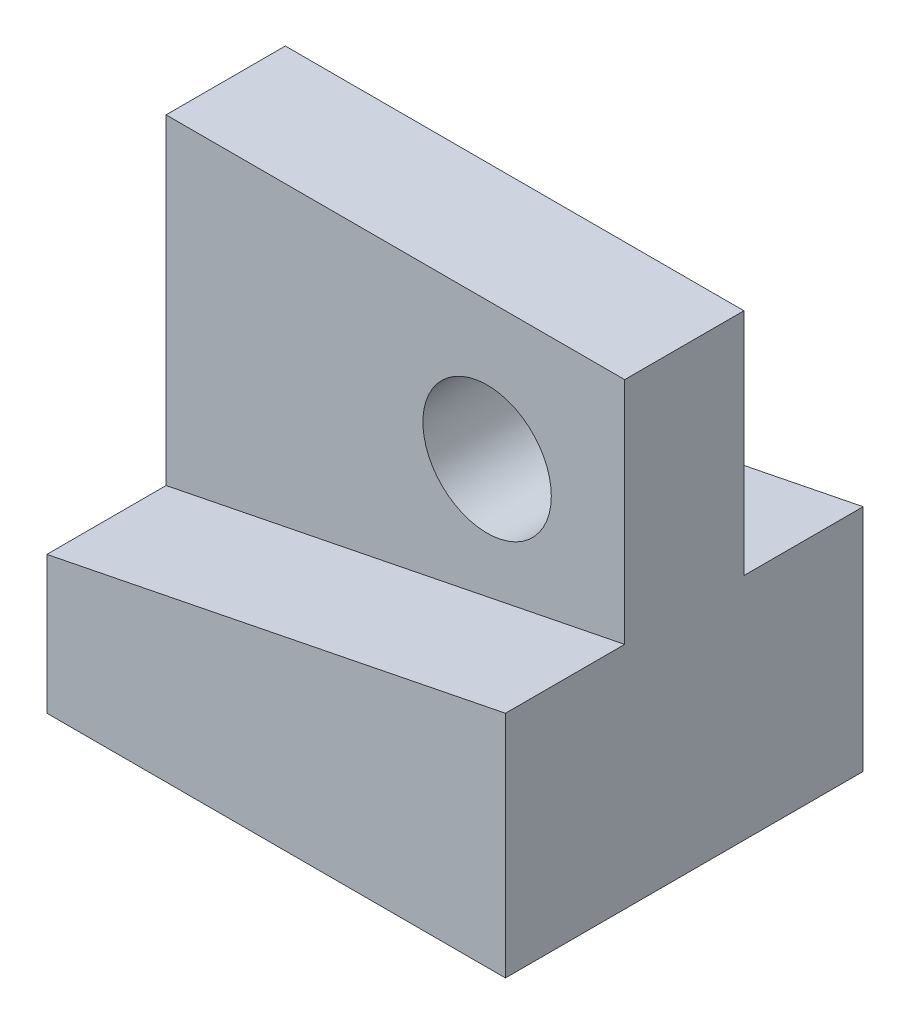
ISO-10303-21;
HEADER;
FILE_DESCRIPTION(('STEP AP214'),'2;1');
FILE_NAME('part.step','',(''),(''),'','','');
FILE_SCHEMA(('AUTOMOTIVE_DESIGN { 1 0 10303 214 1 1 1 1 }'));
ENDSEC;
DATA;
#1=APPLICATION_CONTEXT('core data for automotive mechanical design processes');
#2=APPLICATION_PROTOCOL_DEFINITION('international standard','automotive_design',2000,#1);
#3=PRODUCT_CONTEXT('',#1,'mechanical');
#4=PRODUCT('Part','Part','',(#3));
#5=PRODUCT_RELATED_PRODUCT_CATEGORY('part','',(#4));
#6=PRODUCT_DEFINITION_FORMATION('','',#4);
#7=PRODUCT_DEFINITION_CONTEXT('part definition',#1,'design');
#8=PRODUCT_DEFINITION('design','',#6,#7);
#9=PRODUCT_DEFINITION_SHAPE('','',#8);
#10=(LENGTH_UNIT() NAMED_UNIT(*) SI_UNIT(.MILLI.,.METRE.));
#11=(NAMED_UNIT(*) PLANE_ANGLE_UNIT() SI_UNIT($,.RADIAN.));
#12=(NAMED_UNIT(*) SI_UNIT($,.STERADIAN.) SOLID_ANGLE_UNIT());
#13=UNCERTAINTY_MEASURE_WITH_UNIT(LENGTH_MEASURE(1.E-05),#10,'distance_accuracy_value','');
#14=(GEOMETRIC_REPRESENTATION_CONTEXT(3) GLOBAL_UNCERTAINTY_ASSIGNED_CONTEXT((#13)) GLOBAL_UNIT_ASSIGNED_CONTEXT((#10,
#11,#12)) REPRESENTATION_CONTEXT('',''));
#15=CARTESIAN_POINT('',(0.,0.,0.));
#16=DIRECTION('',(0.,0.,1.));
#17=DIRECTION('',(1.,0.,0.));
#18=AXIS2_PLACEMENT_3D('',#15,#16,#17);
#19=CARTESIAN_POINT('',(-25.,25.,19.5));
#20=DIRECTION('',(0.,-1.,0.));
#21=DIRECTION('',(0.,0.,-1.));
#22=AXIS2_PLACEMENT_3D('',#19,#20,#21);
#23=PLANE('',#22);
#24=DIRECTION('',(-1.,0.,0.));
#25=VECTOR('',#24,1.);
#26=CARTESIAN_POINT('',(25.,25.,-6.5));
#27=LINE('',#26,#25);
#28=CARTESIAN_POINT('',(25.,25.,-6.5));
#29=VERTEX_POINT('',#28);
#30=CARTESIAN_POINT('',(-25.,25.,-6.5));
#31=VERTEX_POINT('',#30);
#32=EDGE_CURVE('E108',#29,#31,#27,.T.);
#33=ORIENTED_EDGE('',*,*,#32,.T.);
#34=DIRECTION('',(0.,0.,-1.));
#35=VECTOR('',#34,1.);
#36=CARTESIAN_POINT('',(-25.,25.,19.5));
#37=LINE('',#36,#35);
#38=CARTESIAN_POINT('',(-25.,25.,6.5));
#39=VERTEX_POINT('',#38);
#40=EDGE_CURVE('E147',#39,#31,#37,.T.);
#41=ORIENTED_EDGE('',*,*,#40,.F.);
#42=DIRECTION('',(-1.,0.,0.));
#43=VECTOR('',#42,1.);
#44=CARTESIAN_POINT('',(25.,25.,6.5));
#45=LINE('',#44,#43);
#46=CARTESIAN_POINT('',(25.,25.,6.5));
#47=VERTEX_POINT('',#46);
#48=EDGE_CURVE('E127',#47,#39,#45,.T.);
#49=ORIENTED_EDGE('',*,*,#48,.F.);
#50=DIRECTION('',(0.,0.,-1.));
#51=VECTOR('',#50,1.);
#52=CARTESIAN_POINT('',(25.,25.,19.5));
#53=LINE('',#52,#51);
#54=EDGE_CURVE('E154',#47,#29,#53,.T.);
#55=ORIENTED_EDGE('',*,*,#54,.T.);
#56=EDGE_LOOP('',(#33,#41,#49,#55));
#57=FACE_BOUND('',#56,.T.);
#58=ADVANCED_FACE('F31',(#57),#23,.F.);
#59=CARTESIAN_POINT('',(-25.,25.,19.5));
#60=DIRECTION('',(1.,0.,0.));
#61=DIRECTION('',(0.,0.,-1.));
#62=AXIS2_PLACEMENT_3D('',#59,#60,#61);
#63=PLANE('',#62);
#64=DIRECTION('',(0.,0.,-1.));
#65=VECTOR('',#64,1.);
#66=CARTESIAN_POINT('',(-25.,-10.,-6.5));
#67=LINE('',#66,#65);
#68=CARTESIAN_POINT('',(-25.,-10.,-6.5));
#69=VERTEX_POINT('',#68);
#70=CARTESIAN_POINT('',(-25.,-10.,-19.5));
#71=VERTEX_POINT('',#70);
#72=EDGE_CURVE('E99',#69,#71,#67,.T.);
#73=ORIENTED_EDGE('',*,*,#72,.T.);
#74=DIRECTION('',(0.,-1.,0.));
#75=VECTOR('',#74,1.);
#76=CARTESIAN_POINT('',(-25.,25.,-19.5));
#77=LINE('',#76,#75);
#78=CARTESIAN_POINT('',(-25.,-25.,-19.5));
#79=VERTEX_POINT('',#78);
#80=EDGE_CURVE('E138',#71,#79,#77,.T.);
#81=ORIENTED_EDGE('',*,*,#80,.T.);
#82=DIRECTION('',(0.,0.,-1.));
#83=VECTOR('',#82,1.);
#84=CARTESIAN_POINT('',(-25.,-25.,19.5));
#85=LINE('',#84,#83);
#86=CARTESIAN_POINT('',(-25.,-25.,19.5));
#87=VERTEX_POINT('',#86);
#88=EDGE_CURVE('E11',#87,#79,#85,.T.);
#89=ORIENTED_EDGE('',*,*,#88,.F.);
#90=DIRECTION('',(0.,-1.,0.));
#91=VECTOR('',#90,1.);
#92=CARTESIAN_POINT('',(-25.,25.,19.5));
#93=LINE('',#92,#91);
#94=CARTESIAN_POINT('',(-25.,-10.,19.5));
#95=VERTEX_POINT('',#94);
#96=EDGE_CURVE('E140',#95,#87,#93,.T.);
#97=ORIENTED_EDGE('',*,*,#96,.F.);
#98=DIRECTION('',(0.,0.,1.));
#99=VECTOR('',#98,1.);
#100=CARTESIAN_POINT('',(-25.,-10.,6.5));
#101=LINE('',#100,#99);
#102=CARTESIAN_POINT('',(-25.,-10.,6.5));
#103=VERTEX_POINT('',#102);
#104=EDGE_CURVE('E54',#103,#95,#101,.T.);
#105=ORIENTED_EDGE('',*,*,#104,.F.);
#106=DIRECTION('',(0.,-1.,0.));
#107=VECTOR('',#106,1.);
#108=CARTESIAN_POINT('',(-25.,25.,6.5));
#109=LINE('',#108,#107);
#110=EDGE_CURVE('E129',#39,#103,#109,.T.);
#111=ORIENTED_EDGE('',*,*,#110,.F.);
#112=ORIENTED_EDGE('',*,*,#40,.T.);
#113=DIRECTION('',(0.,-1.,0.));
#114=VECTOR('',#113,1.);
#115=CARTESIAN_POINT('',(-25.,25.,-6.5));
#116=LINE('',#115,#114);
#117=EDGE_CURVE('E102',#31,#69,#116,.T.);
#118=ORIENTED_EDGE('',*,*,#117,.T.);
#119=EDGE_LOOP('',(#73,#81,#89,#97,#105,#111,#112,#118));
#120=FACE_BOUND('',#119,.T.);
#121=ADVANCED_FACE('F33',(#120),#63,.F.);
#122=CARTESIAN_POINT('',(25.,25.,19.5));
#123=DIRECTION('',(-1.,0.,0.));
#124=DIRECTION('',(0.,0.,1.));
#125=AXIS2_PLACEMENT_3D('',#122,#123,#124);
#126=PLANE('',#125);
#127=DIRECTION('',(0.,0.,-1.));
#128=VECTOR('',#127,1.);
#129=CARTESIAN_POINT('',(25.,0.,-6.5));
#130=LINE('',#129,#128);
#131=CARTESIAN_POINT('',(25.,0.,-6.5));
#132=VERTEX_POINT('',#131);
#133=CARTESIAN_POINT('',(25.,0.,-19.5));
#134=VERTEX_POINT('',#133);
#135=EDGE_CURVE('E46',#132,#134,#130,.T.);
#136=ORIENTED_EDGE('',*,*,#135,.F.);
#137=DIRECTION('',(0.,1.,0.));
#138=VECTOR('',#137,1.);
#139=CARTESIAN_POINT('',(25.,0.,-6.5));
#140=LINE('',#139,#138);
#141=EDGE_CURVE('E103',#132,#29,#140,.T.);
#142=ORIENTED_EDGE('',*,*,#141,.T.);
#143=ORIENTED_EDGE('',*,*,#54,.F.);
#144=DIRECTION('',(0.,1.,0.));
#145=VECTOR('',#144,1.);
#146=CARTESIAN_POINT('',(25.,0.,6.5));
#147=LINE('',#146,#145);
#148=CARTESIAN_POINT('',(25.,0.,6.5));
#149=VERTEX_POINT('',#148);
#150=EDGE_CURVE('E125',#149,#47,#147,.T.);
#151=ORIENTED_EDGE('',*,*,#150,.F.);
#152=DIRECTION('',(0.,0.,1.));
#153=VECTOR('',#152,1.);
#154=CARTESIAN_POINT('',(25.,0.,6.5));
#155=LINE('',#154,#153);
#156=CARTESIAN_POINT('',(25.,0.,19.5));
#157=VERTEX_POINT('',#156);
#158=EDGE_CURVE('E135',#149,#157,#155,.T.);
#159=ORIENTED_EDGE('',*,*,#158,.T.);
#160=DIRECTION('',(0.,1.,0.));
#161=VECTOR('',#160,1.);
#162=CARTESIAN_POINT('',(25.,25.,19.5));
#163=LINE('',#162,#161);
#164=CARTESIAN_POINT('',(25.,-25.,19.5));
#165=VERTEX_POINT('',#164);
#166=EDGE_CURVE('E144',#165,#157,#163,.T.);
#167=ORIENTED_EDGE('',*,*,#166,.F.);
#168=DIRECTION('',(0.,0.,-1.));
#169=VECTOR('',#168,1.);
#170=CARTESIAN_POINT('',(25.,-25.,19.5));
#171=LINE('',#170,#169);
#172=CARTESIAN_POINT('',(25.,-25.,-19.5));
#173=VERTEX_POINT('',#172);
#174=EDGE_CURVE('E39',#165,#173,#171,.T.);
#175=ORIENTED_EDGE('',*,*,#174,.T.);
#176=DIRECTION('',(0.,1.,0.));
#177=VECTOR('',#176,1.);
#178=CARTESIAN_POINT('',(25.,25.,-19.5));
#179=LINE('',#178,#177);
#180=EDGE_CURVE('E118',#173,#134,#179,.T.);
#181=ORIENTED_EDGE('',*,*,#180,.T.);
#182=EDGE_LOOP('',(#136,#142,#143,#151,#159,#167,#175,#181));
#183=FACE_BOUND('',#182,.T.);
#184=ADVANCED_FACE('F115',(#183),#126,.F.);
#185=CARTESIAN_POINT('',(-25.,-25.,-19.5));
#186=DIRECTION('',(0.,0.,1.));
#187=DIRECTION('',(1.,0.,0.));
#188=AXIS2_PLACEMENT_3D('',#185,#186,#187);
#189=PLANE('',#188);
#190=DIRECTION('',(0.98058067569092,0.196116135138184,0.));
#191=VECTOR('',#190,1.);
#192=CARTESIAN_POINT('',(-25.,-10.,-19.5));
#193=LINE('',#192,#191);
#194=EDGE_CURVE('E112',#71,#134,#193,.T.);
#195=ORIENTED_EDGE('',*,*,#194,.T.);
#196=ORIENTED_EDGE('',*,*,#180,.F.);
#197=DIRECTION('',(1.,0.,0.));
#198=VECTOR('',#197,1.);
#199=CARTESIAN_POINT('',(-25.,-25.,-19.5));
#200=LINE('',#199,#198);
#201=EDGE_CURVE('E149',#79,#173,#200,.T.);
#202=ORIENTED_EDGE('',*,*,#201,.F.);
#203=ORIENTED_EDGE('',*,*,#80,.F.);
#204=EDGE_LOOP('',(#195,#196,#202,#203));
#205=FACE_BOUND('',#204,.T.);
#206=ADVANCED_FACE('F161',(#205),#189,.F.);
#207=CARTESIAN_POINT('',(-25.,-25.,19.5));
#208=DIRECTION('',(0.,1.,0.));
#209=DIRECTION('',(0.,0.,1.));
#210=AXIS2_PLACEMENT_3D('',#207,#208,#209);
#211=PLANE('',#210);
#212=ORIENTED_EDGE('',*,*,#201,.T.);
#213=ORIENTED_EDGE('',*,*,#174,.F.);
#214=DIRECTION('',(1.,0.,0.));
#215=VECTOR('',#214,1.);
#216=CARTESIAN_POINT('',(-25.,-25.,19.5));
#217=LINE('',#216,#215);
#218=EDGE_CURVE('E142',#87,#165,#217,.T.);
#219=ORIENTED_EDGE('',*,*,#218,.F.);
#220=ORIENTED_EDGE('',*,*,#88,.T.);
#221=EDGE_LOOP('',(#212,#213,#219,#220));
#222=FACE_BOUND('',#221,.T.);
#223=ADVANCED_FACE('F189',(#222),#211,.F.);
#224=CARTESIAN_POINT('',(-25.,-25.,19.5));
#225=DIRECTION('',(0.,0.,1.));
#226=DIRECTION('',(1.,0.,0.));
#227=AXIS2_PLACEMENT_3D('',#224,#225,#226);
#228=PLANE('',#227);
#229=DIRECTION('',(0.98058067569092,0.196116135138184,0.));
#230=VECTOR('',#229,1.);
#231=CARTESIAN_POINT('',(-25.,-10.,19.5));
#232=LINE('',#231,#230);
#233=EDGE_CURVE('E120',#95,#157,#232,.T.);
#234=ORIENTED_EDGE('',*,*,#233,.F.);
#235=ORIENTED_EDGE('',*,*,#96,.T.);
#236=ORIENTED_EDGE('',*,*,#218,.T.);
#237=ORIENTED_EDGE('',*,*,#166,.T.);
#238=EDGE_LOOP('',(#234,#235,#236,#237));
#239=FACE_BOUND('',#238,.T.);
#240=ADVANCED_FACE('F187',(#239),#228,.T.);
#241=CARTESIAN_POINT('',(-25.,-10.,6.5));
#242=DIRECTION('',(0.196116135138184,-0.98058067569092,0.));
#243=DIRECTION('',(0.98058067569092,0.196116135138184,0.));
#244=AXIS2_PLACEMENT_3D('',#241,#242,#243);
#245=PLANE('',#244);
#246=ORIENTED_EDGE('',*,*,#233,.T.);
#247=ORIENTED_EDGE('',*,*,#158,.F.);
#248=DIRECTION('',(0.98058067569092,0.196116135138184,0.));
#249=VECTOR('',#248,1.);
#250=CARTESIAN_POINT('',(-25.,-10.,6.5));
#251=LINE('',#250,#249);
#252=EDGE_CURVE('E131',#103,#149,#251,.T.);
#253=ORIENTED_EDGE('',*,*,#252,.F.);
#254=ORIENTED_EDGE('',*,*,#104,.T.);
#255=EDGE_LOOP('',(#246,#247,#253,#254));
#256=FACE_BOUND('',#255,.T.);
#257=ADVANCED_FACE('F177',(#256),#245,.F.);
#258=CARTESIAN_POINT('',(25.,25.,6.5));
#259=DIRECTION('',(0.,0.,1.));
#260=DIRECTION('',(1.,0.,0.));
#261=AXIS2_PLACEMENT_3D('',#258,#259,#260);
#262=PLANE('',#261);
#263=CARTESIAN_POINT('',(10.,10.,6.5));
#264=DIRECTION('',(0.,0.,1.));
#265=DIRECTION('',(1.,0.,0.));
#266=AXIS2_PLACEMENT_3D('',#263,#264,#265);
#267=CIRCLE('',#266,7.);
#268=CARTESIAN_POINT('',(17.,10.,6.5));
#269=VERTEX_POINT('',#268);
#270=EDGE_CURVE('E165',#269,#269,#267,.T.);
#271=ORIENTED_EDGE('',*,*,#270,.F.);
#272=EDGE_LOOP('',(#271));
#273=FACE_BOUND('',#272,.T.);
#274=ORIENTED_EDGE('',*,*,#150,.T.);
#275=ORIENTED_EDGE('',*,*,#48,.T.);
#276=ORIENTED_EDGE('',*,*,#110,.T.);
#277=ORIENTED_EDGE('',*,*,#252,.T.);
#278=EDGE_LOOP('',(#274,#275,#276,#277));
#279=FACE_BOUND('',#278,.T.);
#280=ADVANCED_FACE('F174',(#273,#279),#262,.T.);
#281=CARTESIAN_POINT('',(-25.,-10.,-6.5));
#282=DIRECTION('',(-0.196116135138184,0.98058067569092,0.));
#283=DIRECTION('',(-0.98058067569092,-0.196116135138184,0.));
#284=AXIS2_PLACEMENT_3D('',#281,#282,#283);
#285=PLANE('',#284);
#286=ORIENTED_EDGE('',*,*,#194,.F.);
#287=ORIENTED_EDGE('',*,*,#72,.F.);
#288=DIRECTION('',(0.98058067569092,0.196116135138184,0.));
#289=VECTOR('',#288,1.);
#290=CARTESIAN_POINT('',(-25.,-10.,-6.5));
#291=LINE('',#290,#289);
#292=EDGE_CURVE('E95',#69,#132,#291,.T.);
#293=ORIENTED_EDGE('',*,*,#292,.T.);
#294=ORIENTED_EDGE('',*,*,#135,.T.);
#295=EDGE_LOOP('',(#286,#287,#293,#294));
#296=FACE_BOUND('',#295,.T.);
#297=ADVANCED_FACE('F97',(#296),#285,.T.);
#298=CARTESIAN_POINT('',(25.,25.,-6.5));
#299=DIRECTION('',(0.,0.,-1.));
#300=DIRECTION('',(1.,0.,0.));
#301=AXIS2_PLACEMENT_3D('',#298,#299,#300);
#302=PLANE('',#301);
#303=CARTESIAN_POINT('',(10.,10.,-6.5));
#304=DIRECTION('',(0.,0.,1.));
#305=DIRECTION('',(1.,0.,0.));
#306=AXIS2_PLACEMENT_3D('',#303,#304,#305);
#307=CIRCLE('',#306,7.);
#308=CARTESIAN_POINT('',(17.,10.,-6.5));
#309=VERTEX_POINT('',#308);
#310=EDGE_CURVE('E163',#309,#309,#307,.T.);
#311=ORIENTED_EDGE('',*,*,#310,.T.);
#312=EDGE_LOOP('',(#311));
#313=FACE_BOUND('',#312,.T.);
#314=ORIENTED_EDGE('',*,*,#141,.F.);
#315=ORIENTED_EDGE('',*,*,#292,.F.);
#316=ORIENTED_EDGE('',*,*,#117,.F.);
#317=ORIENTED_EDGE('',*,*,#32,.F.);
#318=EDGE_LOOP('',(#314,#315,#316,#317));
#319=FACE_BOUND('',#318,.T.);
#320=ADVANCED_FACE('F106',(#313,#319),#302,.T.);
#321=CARTESIAN_POINT('',(10.,10.,-6.5));
#322=DIRECTION('',(0.,0.,1.));
#323=DIRECTION('',(1.,0.,0.));
#324=AXIS2_PLACEMENT_3D('',#321,#322,#323);
#325=CYLINDRICAL_SURFACE('',#324,7.);
#326=CARTESIAN_POINT('',(17.,10.,-6.5));
#327=CARTESIAN_POINT('',(17.,10.,-6.36458333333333));
#328=CARTESIAN_POINT('',(17.,10.,-6.22916666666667));
#329=CARTESIAN_POINT('',(17.,10.,-5.95833333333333));
#330=CARTESIAN_POINT('',(17.,10.,-5.82291666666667));
#331=CARTESIAN_POINT('',(17.,10.,-5.55208333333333));
#332=CARTESIAN_POINT('',(17.,10.,-5.41666666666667));
#333=CARTESIAN_POINT('',(17.,10.,-5.14583333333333));
#334=CARTESIAN_POINT('',(17.,10.,-5.01041666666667));
#335=CARTESIAN_POINT('',(17.,10.,-4.73958333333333));
#336=CARTESIAN_POINT('',(17.,10.,-4.60416666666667));
#337=CARTESIAN_POINT('',(17.,10.,-4.33333333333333));
#338=CARTESIAN_POINT('',(17.,10.,-4.19791666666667));
#339=CARTESIAN_POINT('',(17.,10.,-3.92708333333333));
#340=CARTESIAN_POINT('',(17.,10.,-3.79166666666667));
#341=CARTESIAN_POINT('',(17.,10.,-3.52083333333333));
#342=CARTESIAN_POINT('',(17.,10.,-3.38541666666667));
#343=CARTESIAN_POINT('',(17.,10.,-3.11458333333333));
#344=CARTESIAN_POINT('',(17.,10.,-2.97916666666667));
#345=CARTESIAN_POINT('',(17.,10.,-2.70833333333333));
#346=CARTESIAN_POINT('',(17.,10.,-2.57291666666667));
#347=CARTESIAN_POINT('',(17.,10.,-2.30208333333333));
#348=CARTESIAN_POINT('',(17.,10.,-2.16666666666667));
#349=CARTESIAN_POINT('',(17.,10.,-1.89583333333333));
#350=CARTESIAN_POINT('',(17.,10.,-1.76041666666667));
#351=CARTESIAN_POINT('',(17.,10.,-1.48958333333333));
#352=CARTESIAN_POINT('',(17.,10.,-1.35416666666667));
#353=CARTESIAN_POINT('',(17.,10.,-1.08333333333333));
#354=CARTESIAN_POINT('',(17.,10.,-0.947916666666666));
#355=CARTESIAN_POINT('',(17.,10.,-0.677083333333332));
#356=CARTESIAN_POINT('',(17.,10.,-0.541666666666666));
#357=CARTESIAN_POINT('',(17.,10.,-0.270833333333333));
#358=CARTESIAN_POINT('',(17.,10.,-0.135416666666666));
#359=CARTESIAN_POINT('',(17.,10.,0.135416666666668));
#360=CARTESIAN_POINT('',(17.,10.,0.270833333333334));
#361=CARTESIAN_POINT('',(17.,10.,0.541666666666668));
#362=CARTESIAN_POINT('',(17.,10.,0.677083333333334));
#363=CARTESIAN_POINT('',(17.,10.,0.947916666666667));
#364=CARTESIAN_POINT('',(17.,10.,1.08333333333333));
#365=CARTESIAN_POINT('',(17.,10.,1.35416666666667));
#366=CARTESIAN_POINT('',(17.,10.,1.48958333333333));
#367=CARTESIAN_POINT('',(17.,10.,1.76041666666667));
#368=CARTESIAN_POINT('',(17.,10.,1.89583333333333));
#369=CARTESIAN_POINT('',(17.,10.,2.16666666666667));
#370=CARTESIAN_POINT('',(17.,10.,2.30208333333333));
#371=CARTESIAN_POINT('',(17.,10.,2.57291666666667));
#372=CARTESIAN_POINT('',(17.,10.,2.70833333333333));
#373=CARTESIAN_POINT('',(17.,10.,2.97916666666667));
#374=CARTESIAN_POINT('',(17.,10.,3.11458333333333));
#375=CARTESIAN_POINT('',(17.,10.,3.38541666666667));
#376=CARTESIAN_POINT('',(17.,10.,3.52083333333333));
#377=CARTESIAN_POINT('',(17.,10.,3.79166666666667));
#378=CARTESIAN_POINT('',(17.,10.,3.92708333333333));
#379=CARTESIAN_POINT('',(17.,10.,4.19791666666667));
#380=CARTESIAN_POINT('',(17.,10.,4.33333333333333));
#381=CARTESIAN_POINT('',(17.,10.,4.60416666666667));
#382=CARTESIAN_POINT('',(17.,10.,4.73958333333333));
#383=CARTESIAN_POINT('',(17.,10.,5.01041666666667));
#384=CARTESIAN_POINT('',(17.,10.,5.14583333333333));
#385=CARTESIAN_POINT('',(17.,10.,5.41666666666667));
#386=CARTESIAN_POINT('',(17.,10.,5.55208333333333));
#387=CARTESIAN_POINT('',(17.,10.,5.82291666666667));
#388=CARTESIAN_POINT('',(17.,10.,5.95833333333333));
#389=CARTESIAN_POINT('',(17.,10.,6.22916666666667));
#390=CARTESIAN_POINT('',(17.,10.,6.36458333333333));
#391=CARTESIAN_POINT('',(17.,10.,6.5));
#392=B_SPLINE_CURVE_WITH_KNOTS('',3,(#326,#327,#328,#329,#330,#331,#332,#333,#334,#335,#336,
#337,#338,#339,#340,#341,#342,#343,#344,#345,#346,#347,#348,#349,#350,#351,#352,#353,#354,#355,
#356,#357,#358,#359,#360,#361,#362,#363,#364,#365,#366,#367,#368,#369,#370,#371,#372,#373,#374,
#375,#376,#377,#378,#379,#380,#381,#382,#383,#384,#385,#386,#387,#388,#389,#390,#391),
.UNSPECIFIED.,.F.,.F.,(4,2,2,2,2,2,2,2,2,2,2,2,2,2,2,2,2,2,2,2,2,2,2,2,2,2,2,2,2,2,2,2,4),(0.,
0.40625,0.8125,1.21875,1.625,2.03125,2.4375,2.84375,3.25,3.65625,4.0625,4.46875,4.875,5.28125,
5.6875,6.09375,6.5,6.90625,7.3125,7.71875,8.125,8.53125,8.9375,9.34375,9.75,10.15625,10.5625,
10.96875,11.375,11.78125,12.1875,12.59375,13.),.UNSPECIFIED.);
#393=EDGE_CURVE('BSEAM172',#309,#269,#392,.T.);
#394=ORIENTED_EDGE('',*,*,#310,.F.);
#395=ORIENTED_EDGE('',*,*,#270,.T.);
#396=ORIENTED_EDGE('',*,*,#393,.T.);
#397=ORIENTED_EDGE('',*,*,#393,.F.);
#398=EDGE_LOOP('',(#394,#396,#395,#397));
#399=FACE_BOUND('',#398,.T.);
#400=ADVANCED_FACE('F172',(#399),#325,.F.);
#401=CLOSED_SHELL('',(#58,#121,#184,#206,#223,#240,#257,#280,#297,#320,#400));
#402=MANIFOLD_SOLID_BREP('B2',#401);
#403=ADVANCED_BREP_SHAPE_REPRESENTATION('',(#18,#402),#14);
#404=SHAPE_DEFINITION_REPRESENTATION(#9,#403);
ENDSEC;
END-ISO-10303-21;
